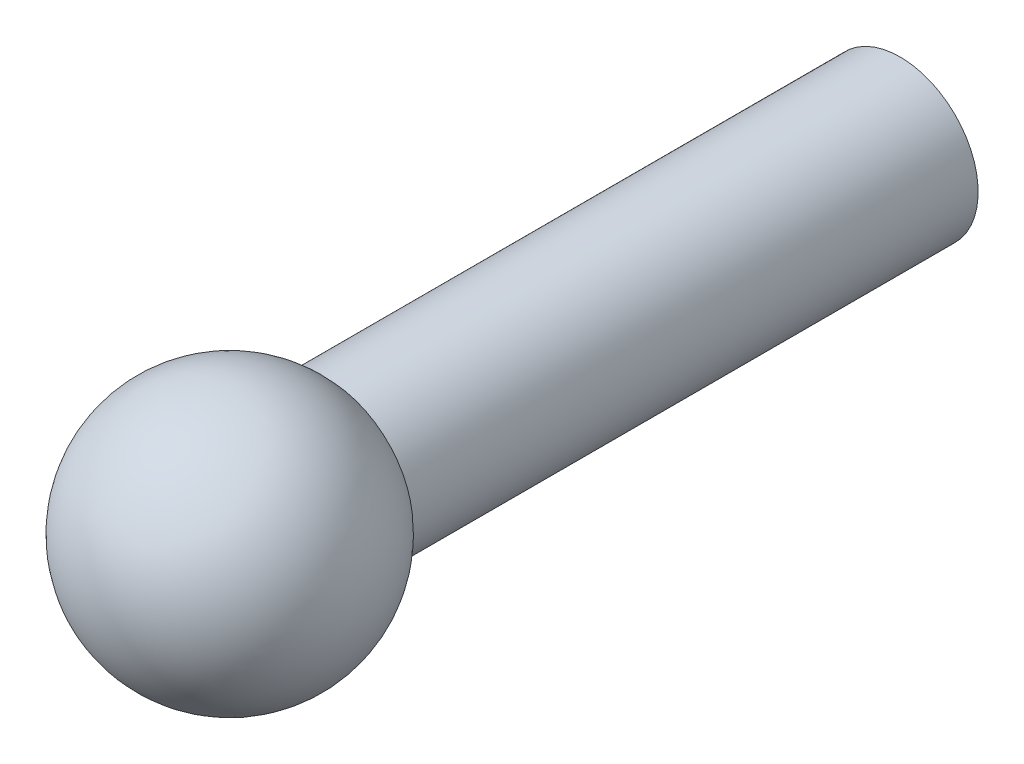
ISO-10303-21;
HEADER;
FILE_DESCRIPTION(('STEP AP214'),'2;1');
FILE_NAME('part.step','',(''),(''),'','','');
FILE_SCHEMA(('AUTOMOTIVE_DESIGN { 1 0 10303 214 1 1 1 1 }'));
ENDSEC;
DATA;
#1=APPLICATION_CONTEXT('core data for automotive mechanical design processes');
#2=APPLICATION_PROTOCOL_DEFINITION('international standard','automotive_design',2000,#1);
#3=PRODUCT_CONTEXT('',#1,'mechanical');
#4=PRODUCT('Part','Part','',(#3));
#5=PRODUCT_RELATED_PRODUCT_CATEGORY('part','',(#4));
#6=PRODUCT_DEFINITION_FORMATION('','',#4);
#7=PRODUCT_DEFINITION_CONTEXT('part definition',#1,'design');
#8=PRODUCT_DEFINITION('design','',#6,#7);
#9=PRODUCT_DEFINITION_SHAPE('','',#8);
#10=(LENGTH_UNIT() NAMED_UNIT(*) SI_UNIT(.MILLI.,.METRE.));
#11=(NAMED_UNIT(*) PLANE_ANGLE_UNIT() SI_UNIT($,.RADIAN.));
#12=(NAMED_UNIT(*) SI_UNIT($,.STERADIAN.) SOLID_ANGLE_UNIT());
#13=UNCERTAINTY_MEASURE_WITH_UNIT(LENGTH_MEASURE(1.E-05),#10,'distance_accuracy_value','');
#14=(GEOMETRIC_REPRESENTATION_CONTEXT(3) GLOBAL_UNCERTAINTY_ASSIGNED_CONTEXT((#13)) GLOBAL_UNIT_ASSIGNED_CONTEXT((#10,
#11,#12)) REPRESENTATION_CONTEXT('',''));
#15=CARTESIAN_POINT('',(0.,0.,0.));
#16=DIRECTION('',(0.,0.,1.));
#17=DIRECTION('',(1.,0.,0.));
#18=AXIS2_PLACEMENT_3D('',#15,#16,#17);
#19=CARTESIAN_POINT('',(0.,0.,13.));
#20=DIRECTION('',(0.,0.,-1.));
#21=DIRECTION('',(-1.,0.,0.));
#22=AXIS2_PLACEMENT_3D('',#19,#20,#21);
#23=CONICAL_SURFACE('',#22,4.,1.02974425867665);
#24=CARTESIAN_POINT('',(0.,0.,15.4034424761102));
#25=VERTEX_POINT('',#24);
#26=VERTEX_LOOP('',#25);
#27=FACE_BOUND('',#26,.T.);
#28=CARTESIAN_POINT('',(0.,0.,13.));
#29=DIRECTION('',(0.,0.,-1.));
#30=DIRECTION('',(-1.,0.,0.));
#31=AXIS2_PLACEMENT_3D('',#28,#29,#30);
#32=CIRCLE('',#31,4.);
#33=CARTESIAN_POINT('',(-4.,0.,13.));
#34=VERTEX_POINT('',#33);
#35=EDGE_CURVE('E30',#34,#34,#32,.T.);
#36=ORIENTED_EDGE('',*,*,#35,.T.);
#37=EDGE_LOOP('',(#36));
#38=FACE_BOUND('',#37,.T.);
#39=ADVANCED_FACE('F14',(#27,#38),#23,.F.);
#40=CARTESIAN_POINT('',(0.,0.,0.));
#41=DIRECTION('',(0.,0.,-1.));
#42=DIRECTION('',(-1.,0.,0.));
#43=AXIS2_PLACEMENT_3D('',#40,#41,#42);
#44=CYLINDRICAL_SURFACE('',#43,4.);
#45=ORIENTED_EDGE('',*,*,#35,.F.);
#46=EDGE_LOOP('',(#45));
#47=FACE_BOUND('',#46,.T.);
#48=CARTESIAN_POINT('',(0.,0.,0.));
#49=DIRECTION('',(0.,0.,-1.));
#50=DIRECTION('',(-1.,0.,0.));
#51=AXIS2_PLACEMENT_3D('',#48,#49,#50);
#52=CIRCLE('',#51,4.);
#53=CARTESIAN_POINT('',(-4.,0.,0.));
#54=VERTEX_POINT('',#53);
#55=EDGE_CURVE('E32',#54,#54,#52,.T.);
#56=ORIENTED_EDGE('',*,*,#55,.T.);
#57=EDGE_LOOP('',(#56));
#58=FACE_BOUND('',#57,.T.);
#59=ADVANCED_FACE('F26',(#47,#58),#44,.F.);
#60=CARTESIAN_POINT('',(0.,0.,0.));
#61=DIRECTION('',(0.,0.,-1.));
#62=DIRECTION('',(-1.,0.,0.));
#63=AXIS2_PLACEMENT_3D('',#60,#61,#62);
#64=PLANE('',#63);
#65=ORIENTED_EDGE('',*,*,#55,.F.);
#66=EDGE_LOOP('',(#65));
#67=FACE_BOUND('',#66,.T.);
#68=CARTESIAN_POINT('',(0.,0.,0.));
#69=DIRECTION('',(0.,0.,-1.));
#70=DIRECTION('',(-1.,0.,0.));
#71=AXIS2_PLACEMENT_3D('',#68,#69,#70);
#72=CIRCLE('',#71,7.5);
#73=CARTESIAN_POINT('',(-7.5,0.,0.));
#74=VERTEX_POINT('',#73);
#75=EDGE_CURVE('E21',#74,#74,#72,.T.);
#76=ORIENTED_EDGE('',*,*,#75,.T.);
#77=EDGE_LOOP('',(#76));
#78=FACE_BOUND('',#77,.T.);
#79=ADVANCED_FACE('F42',(#67,#78),#64,.T.);
#80=CARTESIAN_POINT('',(0.,0.,55.));
#81=DIRECTION('',(0.,0.,-1.));
#82=DIRECTION('',(-1.,0.,0.));
#83=AXIS2_PLACEMENT_3D('',#80,#81,#82);
#84=CYLINDRICAL_SURFACE('',#83,7.5);
#85=CARTESIAN_POINT('',(0.,0.,55.));
#86=DIRECTION('',(0.,0.,-1.));
#87=DIRECTION('',(-1.,0.,0.));
#88=AXIS2_PLACEMENT_3D('',#85,#86,#87);
#89=CIRCLE('',#88,7.5);
#90=CARTESIAN_POINT('',(-7.5,0.,55.));
#91=VERTEX_POINT('',#90);
#92=EDGE_CURVE('E9',#91,#91,#89,.T.);
#93=ORIENTED_EDGE('',*,*,#92,.T.);
#94=EDGE_LOOP('',(#93));
#95=FACE_BOUND('',#94,.T.);
#96=ORIENTED_EDGE('',*,*,#75,.F.);
#97=EDGE_LOOP('',(#96));
#98=FACE_BOUND('',#97,.T.);
#99=ADVANCED_FACE('F16',(#95,#98),#84,.T.);
#100=CARTESIAN_POINT('',(0.,0.,64.5));
#101=DIRECTION('',(0.,0.,-1.));
#102=DIRECTION('',(-0.0415754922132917,0.999135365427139,0.));
#103=AXIS2_PLACEMENT_3D('',#100,#101,#102);
#104=SPHERICAL_SURFACE('',#103,12.5);
#105=CARTESIAN_POINT('',(0.,0.,55.));
#106=DIRECTION('',(0.,0.,-1.));
#107=DIRECTION('',(-0.999135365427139,-0.0415754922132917,0.));
#108=AXIS2_PLACEMENT_3D('',#105,#106,#107);
#109=CIRCLE('',#108,8.12403840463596);
#110=CARTESIAN_POINT('',(-8.11701408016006,-0.337760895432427,55.));
#111=VERTEX_POINT('',#110);
#112=EDGE_CURVE('E33',#111,#111,#109,.T.);
#113=ORIENTED_EDGE('',*,*,#112,.F.);
#114=EDGE_LOOP('',(#113));
#115=FACE_BOUND('',#114,.T.);
#116=ADVANCED_FACE('F45',(#115),#104,.T.);
#117=CARTESIAN_POINT('',(0.,0.,55.));
#118=DIRECTION('',(0.,0.,1.));
#119=DIRECTION('',(0.999135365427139,0.0415754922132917,0.));
#120=AXIS2_PLACEMENT_3D('',#117,#118,#119);
#121=PLANE('',#120);
#122=ORIENTED_EDGE('',*,*,#92,.F.);
#123=EDGE_LOOP('',(#122));
#124=FACE_BOUND('',#123,.T.);
#125=ORIENTED_EDGE('',*,*,#112,.T.);
#126=EDGE_LOOP('',(#125));
#127=FACE_BOUND('',#126,.T.);
#128=ADVANCED_FACE('F47',(#124,#127),#121,.F.);
#129=CLOSED_SHELL('',(#39,#59,#79,#99,#116,#128));
#130=MANIFOLD_SOLID_BREP('B1',#129);
#131=ADVANCED_BREP_SHAPE_REPRESENTATION('',(#18,#130),#14);
#132=SHAPE_DEFINITION_REPRESENTATION(#9,#131);
ENDSEC;
END-ISO-10303-21;
